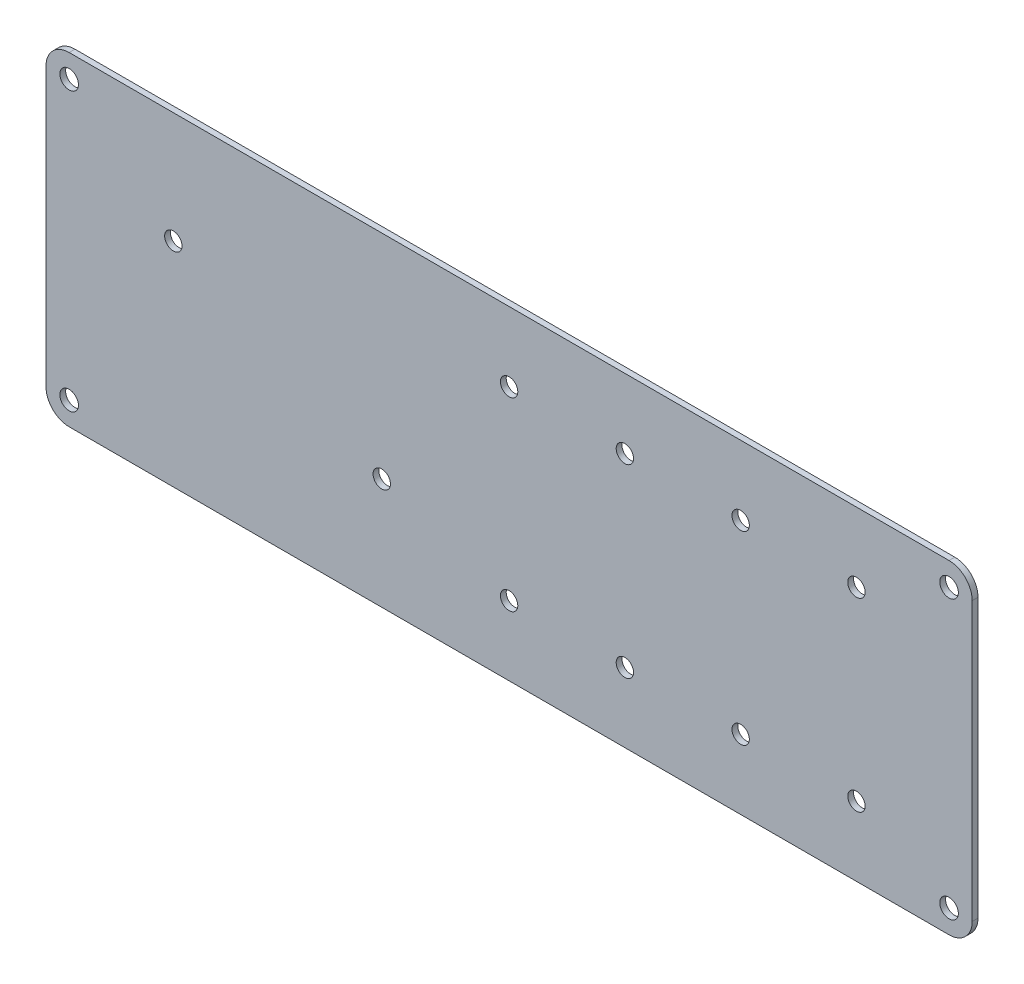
ISO-10303-21;
HEADER;
FILE_DESCRIPTION(('STEP AP214'),'2;1');
FILE_NAME('part.step','',(''),(''),'','','');
FILE_SCHEMA(('AUTOMOTIVE_DESIGN { 1 0 10303 214 1 1 1 1 }'));
ENDSEC;
DATA;
#1=APPLICATION_CONTEXT('core data for automotive mechanical design processes');
#2=APPLICATION_PROTOCOL_DEFINITION('international standard','automotive_design',2000,#1);
#3=PRODUCT_CONTEXT('',#1,'mechanical');
#4=PRODUCT('Part','Part','',(#3));
#5=PRODUCT_RELATED_PRODUCT_CATEGORY('part','',(#4));
#6=PRODUCT_DEFINITION_FORMATION('','',#4);
#7=PRODUCT_DEFINITION_CONTEXT('part definition',#1,'design');
#8=PRODUCT_DEFINITION('design','',#6,#7);
#9=PRODUCT_DEFINITION_SHAPE('','',#8);
#10=(LENGTH_UNIT() NAMED_UNIT(*) SI_UNIT(.MILLI.,.METRE.));
#11=(NAMED_UNIT(*) PLANE_ANGLE_UNIT() SI_UNIT($,.RADIAN.));
#12=(NAMED_UNIT(*) SI_UNIT($,.STERADIAN.) SOLID_ANGLE_UNIT());
#13=UNCERTAINTY_MEASURE_WITH_UNIT(LENGTH_MEASURE(1.E-05),#10,'distance_accuracy_value','');
#14=(GEOMETRIC_REPRESENTATION_CONTEXT(3) GLOBAL_UNCERTAINTY_ASSIGNED_CONTEXT((#13)) GLOBAL_UNIT_ASSIGNED_CONTEXT((#10,
#11,#12)) REPRESENTATION_CONTEXT('',''));
#15=CARTESIAN_POINT('',(0.,0.,0.));
#16=DIRECTION('',(0.,0.,1.));
#17=DIRECTION('',(1.,0.,0.));
#18=AXIS2_PLACEMENT_3D('',#15,#16,#17);
#19=CARTESIAN_POINT('',(0.,0.,1.5875));
#20=DIRECTION('',(1.,0.,0.));
#21=DIRECTION('',(0.,0.,-1.));
#22=AXIS2_PLACEMENT_3D('',#19,#20,#21);
#23=PLANE('',#22);
#24=DIRECTION('',(0.,-1.,0.));
#25=VECTOR('',#24,1.);
#26=CARTESIAN_POINT('',(0.,0.,0.));
#27=LINE('',#26,#25);
#28=CARTESIAN_POINT('',(0.,82.55,0.));
#29=VERTEX_POINT('',#28);
#30=CARTESIAN_POINT('',(0.,6.35,0.));
#31=VERTEX_POINT('',#30);
#32=EDGE_CURVE('E156',#29,#31,#27,.T.);
#33=ORIENTED_EDGE('',*,*,#32,.T.);
#34=DIRECTION('',(0.,0.,-1.));
#35=VECTOR('',#34,1.);
#36=CARTESIAN_POINT('',(0.,6.35,1.5875));
#37=LINE('',#36,#35);
#38=CARTESIAN_POINT('',(0.,6.35,1.5875));
#39=VERTEX_POINT('',#38);
#40=EDGE_CURVE('E11',#31,#39,#37,.F.);
#41=ORIENTED_EDGE('',*,*,#40,.T.);
#42=DIRECTION('',(0.,-1.,0.));
#43=VECTOR('',#42,1.);
#44=CARTESIAN_POINT('',(0.,0.,1.5875));
#45=LINE('',#44,#43);
#46=CARTESIAN_POINT('',(0.,82.55,1.5875));
#47=VERTEX_POINT('',#46);
#48=EDGE_CURVE('E124',#47,#39,#45,.T.);
#49=ORIENTED_EDGE('',*,*,#48,.F.);
#50=DIRECTION('',(0.,0.,-1.));
#51=VECTOR('',#50,1.);
#52=CARTESIAN_POINT('',(0.,82.55,1.5875));
#53=LINE('',#52,#51);
#54=EDGE_CURVE('E40',#47,#29,#53,.T.);
#55=ORIENTED_EDGE('',*,*,#54,.T.);
#56=EDGE_LOOP('',(#33,#41,#49,#55));
#57=FACE_BOUND('',#56,.T.);
#58=ADVANCED_FACE('F32',(#57),#23,.F.);
#59=CARTESIAN_POINT('',(0.,0.,1.5875));
#60=DIRECTION('',(0.,1.,0.));
#61=DIRECTION('',(0.,0.,1.));
#62=AXIS2_PLACEMENT_3D('',#59,#60,#61);
#63=PLANE('',#62);
#64=DIRECTION('',(1.,0.,0.));
#65=VECTOR('',#64,1.);
#66=CARTESIAN_POINT('',(0.,0.,0.));
#67=LINE('',#66,#65);
#68=CARTESIAN_POINT('',(6.35,0.,0.));
#69=VERTEX_POINT('',#68);
#70=CARTESIAN_POINT('',(247.65,0.,0.));
#71=VERTEX_POINT('',#70);
#72=EDGE_CURVE('E129',#69,#71,#67,.T.);
#73=ORIENTED_EDGE('',*,*,#72,.T.);
#74=DIRECTION('',(0.,0.,-1.));
#75=VECTOR('',#74,1.);
#76=CARTESIAN_POINT('',(247.65,0.,1.5875));
#77=LINE('',#76,#75);
#78=CARTESIAN_POINT('',(247.65,0.,1.5875));
#79=VERTEX_POINT('',#78);
#80=EDGE_CURVE('E47',#71,#79,#77,.F.);
#81=ORIENTED_EDGE('',*,*,#80,.T.);
#82=DIRECTION('',(1.,0.,0.));
#83=VECTOR('',#82,1.);
#84=CARTESIAN_POINT('',(0.,0.,1.5875));
#85=LINE('',#84,#83);
#86=CARTESIAN_POINT('',(6.35,0.,1.5875));
#87=VERTEX_POINT('',#86);
#88=EDGE_CURVE('E127',#87,#79,#85,.T.);
#89=ORIENTED_EDGE('',*,*,#88,.F.);
#90=DIRECTION('',(0.,0.,-1.));
#91=VECTOR('',#90,1.);
#92=CARTESIAN_POINT('',(6.35,0.,1.5875));
#93=LINE('',#92,#91);
#94=EDGE_CURVE('E148',#87,#69,#93,.T.);
#95=ORIENTED_EDGE('',*,*,#94,.T.);
#96=EDGE_LOOP('',(#73,#81,#89,#95));
#97=FACE_BOUND('',#96,.T.);
#98=ADVANCED_FACE('F303',(#97),#63,.F.);
#99=CARTESIAN_POINT('',(254.,0.,1.5875));
#100=DIRECTION('',(-1.,0.,0.));
#101=DIRECTION('',(0.,0.,1.));
#102=AXIS2_PLACEMENT_3D('',#99,#100,#101);
#103=PLANE('',#102);
#104=DIRECTION('',(0.,1.,0.));
#105=VECTOR('',#104,1.);
#106=CARTESIAN_POINT('',(254.,0.,0.));
#107=LINE('',#106,#105);
#108=CARTESIAN_POINT('',(254.,6.35,0.));
#109=VERTEX_POINT('',#108);
#110=CARTESIAN_POINT('',(254.,82.55,0.));
#111=VERTEX_POINT('',#110);
#112=EDGE_CURVE('E125',#109,#111,#107,.T.);
#113=ORIENTED_EDGE('',*,*,#112,.T.);
#114=DIRECTION('',(0.,0.,-1.));
#115=VECTOR('',#114,1.);
#116=CARTESIAN_POINT('',(254.,82.55,1.5875));
#117=LINE('',#116,#115);
#118=CARTESIAN_POINT('',(254.,82.55,1.5875));
#119=VERTEX_POINT('',#118);
#120=EDGE_CURVE('E103',#111,#119,#117,.F.);
#121=ORIENTED_EDGE('',*,*,#120,.T.);
#122=DIRECTION('',(0.,1.,0.));
#123=VECTOR('',#122,1.);
#124=CARTESIAN_POINT('',(254.,0.,1.5875));
#125=LINE('',#124,#123);
#126=CARTESIAN_POINT('',(254.,6.35,1.5875));
#127=VERTEX_POINT('',#126);
#128=EDGE_CURVE('E168',#127,#119,#125,.T.);
#129=ORIENTED_EDGE('',*,*,#128,.F.);
#130=DIRECTION('',(0.,0.,-1.));
#131=VECTOR('',#130,1.);
#132=CARTESIAN_POINT('',(254.,6.35,1.5875));
#133=LINE('',#132,#131);
#134=EDGE_CURVE('E108',#127,#109,#133,.T.);
#135=ORIENTED_EDGE('',*,*,#134,.T.);
#136=EDGE_LOOP('',(#113,#121,#129,#135));
#137=FACE_BOUND('',#136,.T.);
#138=ADVANCED_FACE('F300',(#137),#103,.F.);
#139=CARTESIAN_POINT('',(0.,88.9,1.5875));
#140=DIRECTION('',(0.,-1.,0.));
#141=DIRECTION('',(0.,0.,-1.));
#142=AXIS2_PLACEMENT_3D('',#139,#140,#141);
#143=PLANE('',#142);
#144=DIRECTION('',(-1.,0.,0.));
#145=VECTOR('',#144,1.);
#146=CARTESIAN_POINT('',(0.,88.9,1.5875));
#147=LINE('',#146,#145);
#148=CARTESIAN_POINT('',(247.65,88.9,1.5875));
#149=VERTEX_POINT('',#148);
#150=CARTESIAN_POINT('',(6.35,88.9,1.5875));
#151=VERTEX_POINT('',#150);
#152=EDGE_CURVE('E118',#149,#151,#147,.T.);
#153=ORIENTED_EDGE('',*,*,#152,.F.);
#154=DIRECTION('',(0.,0.,-1.));
#155=VECTOR('',#154,1.);
#156=CARTESIAN_POINT('',(247.65,88.9,1.5875));
#157=LINE('',#156,#155);
#158=CARTESIAN_POINT('',(247.65,88.9,0.));
#159=VERTEX_POINT('',#158);
#160=EDGE_CURVE('E102',#149,#159,#157,.T.);
#161=ORIENTED_EDGE('',*,*,#160,.T.);
#162=DIRECTION('',(-1.,0.,0.));
#163=VECTOR('',#162,1.);
#164=CARTESIAN_POINT('',(0.,88.9,0.));
#165=LINE('',#164,#163);
#166=CARTESIAN_POINT('',(6.35,88.9,0.));
#167=VERTEX_POINT('',#166);
#168=EDGE_CURVE('E115',#159,#167,#165,.T.);
#169=ORIENTED_EDGE('',*,*,#168,.T.);
#170=DIRECTION('',(0.,0.,-1.));
#171=VECTOR('',#170,1.);
#172=CARTESIAN_POINT('',(6.35,88.9,1.5875));
#173=LINE('',#172,#171);
#174=EDGE_CURVE('E120',#167,#151,#173,.F.);
#175=ORIENTED_EDGE('',*,*,#174,.T.);
#176=EDGE_LOOP('',(#153,#161,#169,#175));
#177=FACE_BOUND('',#176,.T.);
#178=ADVANCED_FACE('F114',(#177),#143,.F.);
#179=CARTESIAN_POINT('',(0.,0.,1.5875));
#180=DIRECTION('',(0.,0.,-1.));
#181=DIRECTION('',(-1.,0.,0.));
#182=AXIS2_PLACEMENT_3D('',#179,#180,#181);
#183=PLANE('',#182);
#184=CARTESIAN_POINT('',(92.075,30.48,1.5875));
#185=DIRECTION('',(0.,0.,-1.));
#186=DIRECTION('',(-1.,0.,0.));
#187=AXIS2_PLACEMENT_3D('',#184,#185,#186);
#188=CIRCLE('',#187,2.38125000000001);
#189=CARTESIAN_POINT('',(89.69375,30.48,1.5875));
#190=VERTEX_POINT('',#189);
#191=EDGE_CURVE('E246',#190,#190,#188,.T.);
#192=ORIENTED_EDGE('',*,*,#191,.T.);
#193=EDGE_LOOP('',(#192));
#194=FACE_BOUND('',#193,.T.);
#195=CARTESIAN_POINT('',(34.925,58.42,1.5875));
#196=DIRECTION('',(0.,0.,-1.));
#197=DIRECTION('',(-1.,0.,0.));
#198=AXIS2_PLACEMENT_3D('',#195,#196,#197);
#199=CIRCLE('',#198,2.38125);
#200=CARTESIAN_POINT('',(32.54375,58.42,1.5875));
#201=VERTEX_POINT('',#200);
#202=EDGE_CURVE('E238',#201,#201,#199,.T.);
#203=ORIENTED_EDGE('',*,*,#202,.T.);
#204=EDGE_LOOP('',(#203));
#205=FACE_BOUND('',#204,.T.);
#206=CARTESIAN_POINT('',(127.,69.85,1.5875));
#207=DIRECTION('',(0.,0.,-1.));
#208=DIRECTION('',(-1.,0.,0.));
#209=AXIS2_PLACEMENT_3D('',#206,#207,#208);
#210=CIRCLE('',#209,2.38124999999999);
#211=CARTESIAN_POINT('',(124.61875,69.85,1.5875));
#212=VERTEX_POINT('',#211);
#213=EDGE_CURVE('E232',#212,#212,#210,.T.);
#214=ORIENTED_EDGE('',*,*,#213,.T.);
#215=EDGE_LOOP('',(#214));
#216=FACE_BOUND('',#215,.T.);
#217=CARTESIAN_POINT('',(158.75,69.85,1.5875));
#218=DIRECTION('',(0.,0.,-1.));
#219=DIRECTION('',(-1.,0.,0.));
#220=AXIS2_PLACEMENT_3D('',#217,#218,#219);
#221=CIRCLE('',#220,2.38125);
#222=CARTESIAN_POINT('',(156.36875,69.85,1.5875));
#223=VERTEX_POINT('',#222);
#224=EDGE_CURVE('E226',#223,#223,#221,.T.);
#225=ORIENTED_EDGE('',*,*,#224,.T.);
#226=EDGE_LOOP('',(#225));
#227=FACE_BOUND('',#226,.T.);
#228=CARTESIAN_POINT('',(190.5,69.85,1.5875));
#229=DIRECTION('',(0.,0.,-1.));
#230=DIRECTION('',(-1.,0.,0.));
#231=AXIS2_PLACEMENT_3D('',#228,#229,#230);
#232=CIRCLE('',#231,2.38125);
#233=CARTESIAN_POINT('',(188.11875,69.85,1.5875));
#234=VERTEX_POINT('',#233);
#235=EDGE_CURVE('E220',#234,#234,#232,.T.);
#236=ORIENTED_EDGE('',*,*,#235,.T.);
#237=EDGE_LOOP('',(#236));
#238=FACE_BOUND('',#237,.T.);
#239=CARTESIAN_POINT('',(222.25,69.85,1.5875));
#240=DIRECTION('',(0.,0.,-1.));
#241=DIRECTION('',(-1.,0.,0.));
#242=AXIS2_PLACEMENT_3D('',#239,#240,#241);
#243=CIRCLE('',#242,2.38125);
#244=CARTESIAN_POINT('',(219.86875,69.85,1.5875));
#245=VERTEX_POINT('',#244);
#246=EDGE_CURVE('E214',#245,#245,#243,.T.);
#247=ORIENTED_EDGE('',*,*,#246,.T.);
#248=EDGE_LOOP('',(#247));
#249=FACE_BOUND('',#248,.T.);
#250=CARTESIAN_POINT('',(127.,19.05,1.5875));
#251=DIRECTION('',(0.,0.,-1.));
#252=DIRECTION('',(-1.,0.,0.));
#253=AXIS2_PLACEMENT_3D('',#250,#251,#252);
#254=CIRCLE('',#253,2.38125000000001);
#255=CARTESIAN_POINT('',(124.61875,19.05,1.5875));
#256=VERTEX_POINT('',#255);
#257=EDGE_CURVE('E208',#256,#256,#254,.T.);
#258=ORIENTED_EDGE('',*,*,#257,.T.);
#259=EDGE_LOOP('',(#258));
#260=FACE_BOUND('',#259,.T.);
#261=CARTESIAN_POINT('',(158.75,19.05,1.5875));
#262=DIRECTION('',(0.,0.,-1.));
#263=DIRECTION('',(-1.,0.,0.));
#264=AXIS2_PLACEMENT_3D('',#261,#262,#263);
#265=CIRCLE('',#264,2.38125000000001);
#266=CARTESIAN_POINT('',(156.36875,19.05,1.5875));
#267=VERTEX_POINT('',#266);
#268=EDGE_CURVE('E202',#267,#267,#265,.T.);
#269=ORIENTED_EDGE('',*,*,#268,.T.);
#270=EDGE_LOOP('',(#269));
#271=FACE_BOUND('',#270,.T.);
#272=CARTESIAN_POINT('',(190.5,19.05,1.5875));
#273=DIRECTION('',(0.,0.,-1.));
#274=DIRECTION('',(-1.,0.,0.));
#275=AXIS2_PLACEMENT_3D('',#272,#273,#274);
#276=CIRCLE('',#275,2.38125000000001);
#277=CARTESIAN_POINT('',(188.11875,19.05,1.5875));
#278=VERTEX_POINT('',#277);
#279=EDGE_CURVE('E196',#278,#278,#276,.T.);
#280=ORIENTED_EDGE('',*,*,#279,.T.);
#281=EDGE_LOOP('',(#280));
#282=FACE_BOUND('',#281,.T.);
#283=CARTESIAN_POINT('',(222.25,19.05,1.5875));
#284=DIRECTION('',(0.,0.,-1.));
#285=DIRECTION('',(-1.,0.,0.));
#286=AXIS2_PLACEMENT_3D('',#283,#284,#285);
#287=CIRCLE('',#286,2.38125000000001);
#288=CARTESIAN_POINT('',(219.86875,19.05,1.5875));
#289=VERTEX_POINT('',#288);
#290=EDGE_CURVE('E190',#289,#289,#287,.T.);
#291=ORIENTED_EDGE('',*,*,#290,.T.);
#292=EDGE_LOOP('',(#291));
#293=FACE_BOUND('',#292,.T.);
#294=CARTESIAN_POINT('',(6.34999999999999,6.35,1.5875));
#295=DIRECTION('',(0.,0.,1.));
#296=DIRECTION('',(1.,0.,0.));
#297=AXIS2_PLACEMENT_3D('',#294,#295,#296);
#298=CIRCLE('',#297,2.5527);
#299=CARTESIAN_POINT('',(8.90269999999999,6.35,1.5875));
#300=VERTEX_POINT('',#299);
#301=EDGE_CURVE('E187',#300,#300,#298,.T.);
#302=ORIENTED_EDGE('',*,*,#301,.F.);
#303=EDGE_LOOP('',(#302));
#304=FACE_BOUND('',#303,.T.);
#305=CARTESIAN_POINT('',(247.65,6.35,1.5875));
#306=DIRECTION('',(0.,0.,1.));
#307=DIRECTION('',(1.,0.,0.));
#308=AXIS2_PLACEMENT_3D('',#305,#306,#307);
#309=CIRCLE('',#308,2.55269999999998);
#310=CARTESIAN_POINT('',(250.2027,6.35,1.5875));
#311=VERTEX_POINT('',#310);
#312=EDGE_CURVE('E181',#311,#311,#309,.T.);
#313=ORIENTED_EDGE('',*,*,#312,.F.);
#314=EDGE_LOOP('',(#313));
#315=FACE_BOUND('',#314,.T.);
#316=CARTESIAN_POINT('',(247.65,82.55,1.5875));
#317=DIRECTION('',(0.,0.,1.));
#318=DIRECTION('',(1.,0.,0.));
#319=AXIS2_PLACEMENT_3D('',#316,#317,#318);
#320=CIRCLE('',#319,2.55270000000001);
#321=CARTESIAN_POINT('',(250.2027,82.55,1.5875));
#322=VERTEX_POINT('',#321);
#323=EDGE_CURVE('E175',#322,#322,#320,.T.);
#324=ORIENTED_EDGE('',*,*,#323,.F.);
#325=EDGE_LOOP('',(#324));
#326=FACE_BOUND('',#325,.T.);
#327=CARTESIAN_POINT('',(6.34999999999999,82.55,1.5875));
#328=DIRECTION('',(0.,0.,1.));
#329=DIRECTION('',(1.,0.,0.));
#330=AXIS2_PLACEMENT_3D('',#327,#328,#329);
#331=CIRCLE('',#330,2.5527);
#332=CARTESIAN_POINT('',(8.90269999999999,82.55,1.5875));
#333=VERTEX_POINT('',#332);
#334=EDGE_CURVE('E164',#333,#333,#331,.T.);
#335=ORIENTED_EDGE('',*,*,#334,.F.);
#336=EDGE_LOOP('',(#335));
#337=FACE_BOUND('',#336,.T.);
#338=ORIENTED_EDGE('',*,*,#128,.T.);
#339=CARTESIAN_POINT('',(247.65,82.55,1.5875));
#340=DIRECTION('',(0.,0.,-1.));
#341=DIRECTION('',(-1.,0.,0.));
#342=AXIS2_PLACEMENT_3D('',#339,#340,#341);
#343=CIRCLE('',#342,6.35);
#344=EDGE_CURVE('E146',#119,#149,#343,.F.);
#345=ORIENTED_EDGE('',*,*,#344,.T.);
#346=ORIENTED_EDGE('',*,*,#152,.T.);
#347=CARTESIAN_POINT('',(6.35,82.55,1.5875));
#348=DIRECTION('',(0.,0.,-1.));
#349=DIRECTION('',(-1.,0.,0.));
#350=AXIS2_PLACEMENT_3D('',#347,#348,#349);
#351=CIRCLE('',#350,6.35);
#352=EDGE_CURVE('E141',#151,#47,#351,.F.);
#353=ORIENTED_EDGE('',*,*,#352,.T.);
#354=ORIENTED_EDGE('',*,*,#48,.T.);
#355=CARTESIAN_POINT('',(6.35,6.35,1.5875));
#356=DIRECTION('',(0.,0.,-1.));
#357=DIRECTION('',(-1.,0.,0.));
#358=AXIS2_PLACEMENT_3D('',#355,#356,#357);
#359=CIRCLE('',#358,6.35);
#360=EDGE_CURVE('E54',#39,#87,#359,.F.);
#361=ORIENTED_EDGE('',*,*,#360,.T.);
#362=ORIENTED_EDGE('',*,*,#88,.T.);
#363=CARTESIAN_POINT('',(247.65,6.35,1.5875));
#364=DIRECTION('',(0.,0.,-1.));
#365=DIRECTION('',(-1.,0.,0.));
#366=AXIS2_PLACEMENT_3D('',#363,#364,#365);
#367=CIRCLE('',#366,6.35);
#368=EDGE_CURVE('E144',#79,#127,#367,.F.);
#369=ORIENTED_EDGE('',*,*,#368,.T.);
#370=EDGE_LOOP('',(#338,#345,#346,#353,#354,#361,#362,#369));
#371=FACE_BOUND('',#370,.T.);
#372=ADVANCED_FACE('F259',(#194,#205,#216,#227,#238,#249,#260,#271,#282,#293,#304,#315,#326,
#337,#371),#183,.F.);
#373=CARTESIAN_POINT('',(0.,0.,0.));
#374=DIRECTION('',(0.,0.,-1.));
#375=DIRECTION('',(-1.,0.,0.));
#376=AXIS2_PLACEMENT_3D('',#373,#374,#375);
#377=PLANE('',#376);
#378=CARTESIAN_POINT('',(92.075,30.48,0.));
#379=DIRECTION('',(0.,0.,-1.));
#380=DIRECTION('',(-1.,0.,0.));
#381=AXIS2_PLACEMENT_3D('',#378,#379,#380);
#382=CIRCLE('',#381,2.38125000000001);
#383=CARTESIAN_POINT('',(89.69375,30.48,0.));
#384=VERTEX_POINT('',#383);
#385=EDGE_CURVE('E249',#384,#384,#382,.T.);
#386=ORIENTED_EDGE('',*,*,#385,.F.);
#387=EDGE_LOOP('',(#386));
#388=FACE_BOUND('',#387,.T.);
#389=CARTESIAN_POINT('',(34.925,58.42,0.));
#390=DIRECTION('',(0.,0.,-1.));
#391=DIRECTION('',(-1.,0.,0.));
#392=AXIS2_PLACEMENT_3D('',#389,#390,#391);
#393=CIRCLE('',#392,2.38125);
#394=CARTESIAN_POINT('',(32.54375,58.42,0.));
#395=VERTEX_POINT('',#394);
#396=EDGE_CURVE('E243',#395,#395,#393,.T.);
#397=ORIENTED_EDGE('',*,*,#396,.F.);
#398=EDGE_LOOP('',(#397));
#399=FACE_BOUND('',#398,.T.);
#400=CARTESIAN_POINT('',(127.,69.85,0.));
#401=DIRECTION('',(0.,0.,-1.));
#402=DIRECTION('',(-1.,0.,0.));
#403=AXIS2_PLACEMENT_3D('',#400,#401,#402);
#404=CIRCLE('',#403,2.38124999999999);
#405=CARTESIAN_POINT('',(124.61875,69.85,0.));
#406=VERTEX_POINT('',#405);
#407=EDGE_CURVE('E235',#406,#406,#404,.T.);
#408=ORIENTED_EDGE('',*,*,#407,.F.);
#409=EDGE_LOOP('',(#408));
#410=FACE_BOUND('',#409,.T.);
#411=CARTESIAN_POINT('',(158.75,69.85,0.));
#412=DIRECTION('',(0.,0.,-1.));
#413=DIRECTION('',(-1.,0.,0.));
#414=AXIS2_PLACEMENT_3D('',#411,#412,#413);
#415=CIRCLE('',#414,2.38125);
#416=CARTESIAN_POINT('',(156.36875,69.85,0.));
#417=VERTEX_POINT('',#416);
#418=EDGE_CURVE('E229',#417,#417,#415,.T.);
#419=ORIENTED_EDGE('',*,*,#418,.F.);
#420=EDGE_LOOP('',(#419));
#421=FACE_BOUND('',#420,.T.);
#422=CARTESIAN_POINT('',(190.5,69.85,0.));
#423=DIRECTION('',(0.,0.,-1.));
#424=DIRECTION('',(-1.,0.,0.));
#425=AXIS2_PLACEMENT_3D('',#422,#423,#424);
#426=CIRCLE('',#425,2.38125);
#427=CARTESIAN_POINT('',(188.11875,69.85,0.));
#428=VERTEX_POINT('',#427);
#429=EDGE_CURVE('E223',#428,#428,#426,.T.);
#430=ORIENTED_EDGE('',*,*,#429,.F.);
#431=EDGE_LOOP('',(#430));
#432=FACE_BOUND('',#431,.T.);
#433=CARTESIAN_POINT('',(222.25,69.85,0.));
#434=DIRECTION('',(0.,0.,-1.));
#435=DIRECTION('',(-1.,0.,0.));
#436=AXIS2_PLACEMENT_3D('',#433,#434,#435);
#437=CIRCLE('',#436,2.38125);
#438=CARTESIAN_POINT('',(219.86875,69.85,0.));
#439=VERTEX_POINT('',#438);
#440=EDGE_CURVE('E217',#439,#439,#437,.T.);
#441=ORIENTED_EDGE('',*,*,#440,.F.);
#442=EDGE_LOOP('',(#441));
#443=FACE_BOUND('',#442,.T.);
#444=CARTESIAN_POINT('',(127.,19.05,0.));
#445=DIRECTION('',(0.,0.,-1.));
#446=DIRECTION('',(-1.,0.,0.));
#447=AXIS2_PLACEMENT_3D('',#444,#445,#446);
#448=CIRCLE('',#447,2.38125000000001);
#449=CARTESIAN_POINT('',(124.61875,19.05,0.));
#450=VERTEX_POINT('',#449);
#451=EDGE_CURVE('E211',#450,#450,#448,.T.);
#452=ORIENTED_EDGE('',*,*,#451,.F.);
#453=EDGE_LOOP('',(#452));
#454=FACE_BOUND('',#453,.T.);
#455=CARTESIAN_POINT('',(158.75,19.05,0.));
#456=DIRECTION('',(0.,0.,-1.));
#457=DIRECTION('',(-1.,0.,0.));
#458=AXIS2_PLACEMENT_3D('',#455,#456,#457);
#459=CIRCLE('',#458,2.38125000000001);
#460=CARTESIAN_POINT('',(156.36875,19.05,0.));
#461=VERTEX_POINT('',#460);
#462=EDGE_CURVE('E205',#461,#461,#459,.T.);
#463=ORIENTED_EDGE('',*,*,#462,.F.);
#464=EDGE_LOOP('',(#463));
#465=FACE_BOUND('',#464,.T.);
#466=CARTESIAN_POINT('',(190.5,19.05,0.));
#467=DIRECTION('',(0.,0.,-1.));
#468=DIRECTION('',(-1.,0.,0.));
#469=AXIS2_PLACEMENT_3D('',#466,#467,#468);
#470=CIRCLE('',#469,2.38125000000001);
#471=CARTESIAN_POINT('',(188.11875,19.05,0.));
#472=VERTEX_POINT('',#471);
#473=EDGE_CURVE('E199',#472,#472,#470,.T.);
#474=ORIENTED_EDGE('',*,*,#473,.F.);
#475=EDGE_LOOP('',(#474));
#476=FACE_BOUND('',#475,.T.);
#477=CARTESIAN_POINT('',(222.25,19.05,0.));
#478=DIRECTION('',(0.,0.,-1.));
#479=DIRECTION('',(-1.,0.,0.));
#480=AXIS2_PLACEMENT_3D('',#477,#478,#479);
#481=CIRCLE('',#480,2.38125000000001);
#482=CARTESIAN_POINT('',(219.86875,19.05,0.));
#483=VERTEX_POINT('',#482);
#484=EDGE_CURVE('E193',#483,#483,#481,.T.);
#485=ORIENTED_EDGE('',*,*,#484,.F.);
#486=EDGE_LOOP('',(#485));
#487=FACE_BOUND('',#486,.T.);
#488=CARTESIAN_POINT('',(6.34999999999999,6.35,0.));
#489=DIRECTION('',(0.,0.,1.));
#490=DIRECTION('',(1.,0.,0.));
#491=AXIS2_PLACEMENT_3D('',#488,#489,#490);
#492=CIRCLE('',#491,2.5527);
#493=CARTESIAN_POINT('',(8.90269999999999,6.35,0.));
#494=VERTEX_POINT('',#493);
#495=EDGE_CURVE('E184',#494,#494,#492,.T.);
#496=ORIENTED_EDGE('',*,*,#495,.T.);
#497=EDGE_LOOP('',(#496));
#498=FACE_BOUND('',#497,.T.);
#499=CARTESIAN_POINT('',(247.65,6.35,0.));
#500=DIRECTION('',(0.,0.,1.));
#501=DIRECTION('',(1.,0.,0.));
#502=AXIS2_PLACEMENT_3D('',#499,#500,#501);
#503=CIRCLE('',#502,2.55269999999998);
#504=CARTESIAN_POINT('',(250.2027,6.35,0.));
#505=VERTEX_POINT('',#504);
#506=EDGE_CURVE('E178',#505,#505,#503,.T.);
#507=ORIENTED_EDGE('',*,*,#506,.T.);
#508=EDGE_LOOP('',(#507));
#509=FACE_BOUND('',#508,.T.);
#510=CARTESIAN_POINT('',(247.65,82.55,0.));
#511=DIRECTION('',(0.,0.,1.));
#512=DIRECTION('',(1.,0.,0.));
#513=AXIS2_PLACEMENT_3D('',#510,#511,#512);
#514=CIRCLE('',#513,2.55270000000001);
#515=CARTESIAN_POINT('',(250.2027,82.55,0.));
#516=VERTEX_POINT('',#515);
#517=EDGE_CURVE('E173',#516,#516,#514,.T.);
#518=ORIENTED_EDGE('',*,*,#517,.T.);
#519=EDGE_LOOP('',(#518));
#520=FACE_BOUND('',#519,.T.);
#521=CARTESIAN_POINT('',(6.34999999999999,82.55,0.));
#522=DIRECTION('',(0.,0.,1.));
#523=DIRECTION('',(1.,0.,0.));
#524=AXIS2_PLACEMENT_3D('',#521,#522,#523);
#525=CIRCLE('',#524,2.5527);
#526=CARTESIAN_POINT('',(8.90269999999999,82.55,0.));
#527=VERTEX_POINT('',#526);
#528=EDGE_CURVE('E161',#527,#527,#525,.T.);
#529=ORIENTED_EDGE('',*,*,#528,.T.);
#530=EDGE_LOOP('',(#529));
#531=FACE_BOUND('',#530,.T.);
#532=ORIENTED_EDGE('',*,*,#168,.F.);
#533=CARTESIAN_POINT('',(247.65,82.55,0.));
#534=DIRECTION('',(0.,0.,-1.));
#535=DIRECTION('',(-1.,0.,0.));
#536=AXIS2_PLACEMENT_3D('',#533,#534,#535);
#537=CIRCLE('',#536,6.35);
#538=EDGE_CURVE('E98',#159,#111,#537,.T.);
#539=ORIENTED_EDGE('',*,*,#538,.T.);
#540=ORIENTED_EDGE('',*,*,#112,.F.);
#541=CARTESIAN_POINT('',(247.65,6.35,0.));
#542=DIRECTION('',(0.,0.,-1.));
#543=DIRECTION('',(-1.,0.,0.));
#544=AXIS2_PLACEMENT_3D('',#541,#542,#543);
#545=CIRCLE('',#544,6.35);
#546=EDGE_CURVE('E109',#109,#71,#545,.T.);
#547=ORIENTED_EDGE('',*,*,#546,.T.);
#548=ORIENTED_EDGE('',*,*,#72,.F.);
#549=CARTESIAN_POINT('',(6.35,6.35,0.));
#550=DIRECTION('',(0.,0.,-1.));
#551=DIRECTION('',(-1.,0.,0.));
#552=AXIS2_PLACEMENT_3D('',#549,#550,#551);
#553=CIRCLE('',#552,6.35);
#554=EDGE_CURVE('E135',#69,#31,#553,.T.);
#555=ORIENTED_EDGE('',*,*,#554,.T.);
#556=ORIENTED_EDGE('',*,*,#32,.F.);
#557=CARTESIAN_POINT('',(6.35,82.55,0.));
#558=DIRECTION('',(0.,0.,-1.));
#559=DIRECTION('',(-1.,0.,0.));
#560=AXIS2_PLACEMENT_3D('',#557,#558,#559);
#561=CIRCLE('',#560,6.35);
#562=EDGE_CURVE('E119',#29,#167,#561,.T.);
#563=ORIENTED_EDGE('',*,*,#562,.T.);
#564=EDGE_LOOP('',(#532,#539,#540,#547,#548,#555,#556,#563));
#565=FACE_BOUND('',#564,.T.);
#566=ADVANCED_FACE('F122',(#388,#399,#410,#421,#432,#443,#454,#465,#476,#487,#498,#509,#520,
#531,#565),#377,.T.);
#567=CARTESIAN_POINT('',(6.34999999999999,82.55,0.));
#568=DIRECTION('',(0.,0.,1.));
#569=DIRECTION('',(1.,0.,0.));
#570=AXIS2_PLACEMENT_3D('',#567,#568,#569);
#571=CYLINDRICAL_SURFACE('',#570,2.5527);
#572=ORIENTED_EDGE('',*,*,#528,.F.);
#573=EDGE_LOOP('',(#572));
#574=FACE_BOUND('',#573,.T.);
#575=ORIENTED_EDGE('',*,*,#334,.T.);
#576=EDGE_LOOP('',(#575));
#577=FACE_BOUND('',#576,.T.);
#578=ADVANCED_FACE('F258',(#574,#577),#571,.F.);
#579=CARTESIAN_POINT('',(247.65,82.55,0.));
#580=DIRECTION('',(0.,0.,1.));
#581=DIRECTION('',(1.,0.,0.));
#582=AXIS2_PLACEMENT_3D('',#579,#580,#581);
#583=CYLINDRICAL_SURFACE('',#582,2.55270000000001);
#584=ORIENTED_EDGE('',*,*,#517,.F.);
#585=EDGE_LOOP('',(#584));
#586=FACE_BOUND('',#585,.T.);
#587=ORIENTED_EDGE('',*,*,#323,.T.);
#588=EDGE_LOOP('',(#587));
#589=FACE_BOUND('',#588,.T.);
#590=ADVANCED_FACE('F289',(#586,#589),#583,.F.);
#591=CARTESIAN_POINT('',(247.65,6.35,0.));
#592=DIRECTION('',(0.,0.,1.));
#593=DIRECTION('',(1.,0.,0.));
#594=AXIS2_PLACEMENT_3D('',#591,#592,#593);
#595=CYLINDRICAL_SURFACE('',#594,2.55269999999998);
#596=ORIENTED_EDGE('',*,*,#506,.F.);
#597=EDGE_LOOP('',(#596));
#598=FACE_BOUND('',#597,.T.);
#599=ORIENTED_EDGE('',*,*,#312,.T.);
#600=EDGE_LOOP('',(#599));
#601=FACE_BOUND('',#600,.T.);
#602=ADVANCED_FACE('F455',(#598,#601),#595,.F.);
#603=CARTESIAN_POINT('',(6.34999999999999,6.35,0.));
#604=DIRECTION('',(0.,0.,1.));
#605=DIRECTION('',(1.,0.,0.));
#606=AXIS2_PLACEMENT_3D('',#603,#604,#605);
#607=CYLINDRICAL_SURFACE('',#606,2.5527);
#608=ORIENTED_EDGE('',*,*,#495,.F.);
#609=EDGE_LOOP('',(#608));
#610=FACE_BOUND('',#609,.T.);
#611=ORIENTED_EDGE('',*,*,#301,.T.);
#612=EDGE_LOOP('',(#611));
#613=FACE_BOUND('',#612,.T.);
#614=ADVANCED_FACE('F326',(#610,#613),#607,.F.);
#615=CARTESIAN_POINT('',(247.65,82.55,1.5875));
#616=DIRECTION('',(0.,0.,-1.));
#617=DIRECTION('',(-1.,0.,0.));
#618=AXIS2_PLACEMENT_3D('',#615,#616,#617);
#619=CYLINDRICAL_SURFACE('',#618,6.35);
#620=ORIENTED_EDGE('',*,*,#344,.F.);
#621=ORIENTED_EDGE('',*,*,#120,.F.);
#622=ORIENTED_EDGE('',*,*,#538,.F.);
#623=ORIENTED_EDGE('',*,*,#160,.F.);
#624=EDGE_LOOP('',(#620,#621,#622,#623));
#625=FACE_BOUND('',#624,.T.);
#626=ADVANCED_FACE('F101',(#625),#619,.T.);
#627=CARTESIAN_POINT('',(247.65,6.35,1.5875));
#628=DIRECTION('',(0.,0.,-1.));
#629=DIRECTION('',(-1.,0.,0.));
#630=AXIS2_PLACEMENT_3D('',#627,#628,#629);
#631=CYLINDRICAL_SURFACE('',#630,6.35);
#632=ORIENTED_EDGE('',*,*,#368,.F.);
#633=ORIENTED_EDGE('',*,*,#80,.F.);
#634=ORIENTED_EDGE('',*,*,#546,.F.);
#635=ORIENTED_EDGE('',*,*,#134,.F.);
#636=EDGE_LOOP('',(#632,#633,#634,#635));
#637=FACE_BOUND('',#636,.T.);
#638=ADVANCED_FACE('F302',(#637),#631,.T.);
#639=CARTESIAN_POINT('',(6.35,6.35,1.5875));
#640=DIRECTION('',(0.,0.,-1.));
#641=DIRECTION('',(-1.,0.,0.));
#642=AXIS2_PLACEMENT_3D('',#639,#640,#641);
#643=CYLINDRICAL_SURFACE('',#642,6.35);
#644=ORIENTED_EDGE('',*,*,#360,.F.);
#645=ORIENTED_EDGE('',*,*,#40,.F.);
#646=ORIENTED_EDGE('',*,*,#554,.F.);
#647=ORIENTED_EDGE('',*,*,#94,.F.);
#648=EDGE_LOOP('',(#644,#645,#646,#647));
#649=FACE_BOUND('',#648,.T.);
#650=ADVANCED_FACE('F306',(#649),#643,.T.);
#651=CARTESIAN_POINT('',(6.35,82.55,1.5875));
#652=DIRECTION('',(0.,0.,-1.));
#653=DIRECTION('',(-1.,0.,0.));
#654=AXIS2_PLACEMENT_3D('',#651,#652,#653);
#655=CYLINDRICAL_SURFACE('',#654,6.35);
#656=ORIENTED_EDGE('',*,*,#352,.F.);
#657=ORIENTED_EDGE('',*,*,#174,.F.);
#658=ORIENTED_EDGE('',*,*,#562,.F.);
#659=ORIENTED_EDGE('',*,*,#54,.F.);
#660=EDGE_LOOP('',(#656,#657,#658,#659));
#661=FACE_BOUND('',#660,.T.);
#662=ADVANCED_FACE('F34',(#661),#655,.T.);
#663=CARTESIAN_POINT('',(222.25,19.05,1.5875));
#664=DIRECTION('',(0.,0.,-1.));
#665=DIRECTION('',(-1.,0.,0.));
#666=AXIS2_PLACEMENT_3D('',#663,#664,#665);
#667=CYLINDRICAL_SURFACE('',#666,2.38125000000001);
#668=ORIENTED_EDGE('',*,*,#290,.F.);
#669=EDGE_LOOP('',(#668));
#670=FACE_BOUND('',#669,.T.);
#671=ORIENTED_EDGE('',*,*,#484,.T.);
#672=EDGE_LOOP('',(#671));
#673=FACE_BOUND('',#672,.T.);
#674=ADVANCED_FACE('F308',(#670,#673),#667,.F.);
#675=CARTESIAN_POINT('',(190.5,19.05,1.5875));
#676=DIRECTION('',(0.,0.,-1.));
#677=DIRECTION('',(-1.,0.,0.));
#678=AXIS2_PLACEMENT_3D('',#675,#676,#677);
#679=CYLINDRICAL_SURFACE('',#678,2.38125000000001);
#680=ORIENTED_EDGE('',*,*,#279,.F.);
#681=EDGE_LOOP('',(#680));
#682=FACE_BOUND('',#681,.T.);
#683=ORIENTED_EDGE('',*,*,#473,.T.);
#684=EDGE_LOOP('',(#683));
#685=FACE_BOUND('',#684,.T.);
#686=ADVANCED_FACE('F313',(#682,#685),#679,.F.);
#687=CARTESIAN_POINT('',(158.75,19.05,1.5875));
#688=DIRECTION('',(0.,0.,-1.));
#689=DIRECTION('',(-1.,0.,0.));
#690=AXIS2_PLACEMENT_3D('',#687,#688,#689);
#691=CYLINDRICAL_SURFACE('',#690,2.38125000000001);
#692=ORIENTED_EDGE('',*,*,#268,.F.);
#693=EDGE_LOOP('',(#692));
#694=FACE_BOUND('',#693,.T.);
#695=ORIENTED_EDGE('',*,*,#462,.T.);
#696=EDGE_LOOP('',(#695));
#697=FACE_BOUND('',#696,.T.);
#698=ADVANCED_FACE('F356',(#694,#697),#691,.F.);
#699=CARTESIAN_POINT('',(127.,19.05,1.5875));
#700=DIRECTION('',(0.,0.,-1.));
#701=DIRECTION('',(-1.,0.,0.));
#702=AXIS2_PLACEMENT_3D('',#699,#700,#701);
#703=CYLINDRICAL_SURFACE('',#702,2.38125000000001);
#704=ORIENTED_EDGE('',*,*,#257,.F.);
#705=EDGE_LOOP('',(#704));
#706=FACE_BOUND('',#705,.T.);
#707=ORIENTED_EDGE('',*,*,#451,.T.);
#708=EDGE_LOOP('',(#707));
#709=FACE_BOUND('',#708,.T.);
#710=ADVANCED_FACE('F366',(#706,#709),#703,.F.);
#711=CARTESIAN_POINT('',(222.25,69.85,1.5875));
#712=DIRECTION('',(0.,0.,-1.));
#713=DIRECTION('',(-1.,0.,0.));
#714=AXIS2_PLACEMENT_3D('',#711,#712,#713);
#715=CYLINDRICAL_SURFACE('',#714,2.38125);
#716=ORIENTED_EDGE('',*,*,#246,.F.);
#717=EDGE_LOOP('',(#716));
#718=FACE_BOUND('',#717,.T.);
#719=ORIENTED_EDGE('',*,*,#440,.T.);
#720=EDGE_LOOP('',(#719));
#721=FACE_BOUND('',#720,.T.);
#722=ADVANCED_FACE('F376',(#718,#721),#715,.F.);
#723=CARTESIAN_POINT('',(190.5,69.85,1.5875));
#724=DIRECTION('',(0.,0.,-1.));
#725=DIRECTION('',(-1.,0.,0.));
#726=AXIS2_PLACEMENT_3D('',#723,#724,#725);
#727=CYLINDRICAL_SURFACE('',#726,2.38125);
#728=ORIENTED_EDGE('',*,*,#235,.F.);
#729=EDGE_LOOP('',(#728));
#730=FACE_BOUND('',#729,.T.);
#731=ORIENTED_EDGE('',*,*,#429,.T.);
#732=EDGE_LOOP('',(#731));
#733=FACE_BOUND('',#732,.T.);
#734=ADVANCED_FACE('F386',(#730,#733),#727,.F.);
#735=CARTESIAN_POINT('',(158.75,69.85,1.5875));
#736=DIRECTION('',(0.,0.,-1.));
#737=DIRECTION('',(-1.,0.,0.));
#738=AXIS2_PLACEMENT_3D('',#735,#736,#737);
#739=CYLINDRICAL_SURFACE('',#738,2.38125);
#740=ORIENTED_EDGE('',*,*,#224,.F.);
#741=EDGE_LOOP('',(#740));
#742=FACE_BOUND('',#741,.T.);
#743=ORIENTED_EDGE('',*,*,#418,.T.);
#744=EDGE_LOOP('',(#743));
#745=FACE_BOUND('',#744,.T.);
#746=ADVANCED_FACE('F396',(#742,#745),#739,.F.);
#747=CARTESIAN_POINT('',(127.,69.85,1.5875));
#748=DIRECTION('',(0.,0.,-1.));
#749=DIRECTION('',(-1.,0.,0.));
#750=AXIS2_PLACEMENT_3D('',#747,#748,#749);
#751=CYLINDRICAL_SURFACE('',#750,2.38124999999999);
#752=ORIENTED_EDGE('',*,*,#213,.F.);
#753=EDGE_LOOP('',(#752));
#754=FACE_BOUND('',#753,.T.);
#755=ORIENTED_EDGE('',*,*,#407,.T.);
#756=EDGE_LOOP('',(#755));
#757=FACE_BOUND('',#756,.T.);
#758=ADVANCED_FACE('F406',(#754,#757),#751,.F.);
#759=CARTESIAN_POINT('',(34.925,58.42,3.175));
#760=DIRECTION('',(0.,0.,-1.));
#761=DIRECTION('',(-1.,0.,0.));
#762=AXIS2_PLACEMENT_3D('',#759,#760,#761);
#763=CYLINDRICAL_SURFACE('',#762,2.38125);
#764=ORIENTED_EDGE('',*,*,#396,.T.);
#765=EDGE_LOOP('',(#764));
#766=FACE_BOUND('',#765,.T.);
#767=ORIENTED_EDGE('',*,*,#202,.F.);
#768=EDGE_LOOP('',(#767));
#769=FACE_BOUND('',#768,.T.);
#770=ADVANCED_FACE('F416',(#766,#769),#763,.F.);
#771=CARTESIAN_POINT('',(92.075,30.48,3.175));
#772=DIRECTION('',(0.,0.,-1.));
#773=DIRECTION('',(-1.,0.,0.));
#774=AXIS2_PLACEMENT_3D('',#771,#772,#773);
#775=CYLINDRICAL_SURFACE('',#774,2.38125000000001);
#776=ORIENTED_EDGE('',*,*,#385,.T.);
#777=EDGE_LOOP('',(#776));
#778=FACE_BOUND('',#777,.T.);
#779=ORIENTED_EDGE('',*,*,#191,.F.);
#780=EDGE_LOOP('',(#779));
#781=FACE_BOUND('',#780,.T.);
#782=ADVANCED_FACE('F253',(#778,#781),#775,.F.);
#783=CLOSED_SHELL('',(#58,#98,#138,#178,#372,#566,#578,#590,#602,#614,#626,#638,#650,#662,#674,
#686,#698,#710,#722,#734,#746,#758,#770,#782));
#784=MANIFOLD_SOLID_BREP('B2',#783);
#785=ADVANCED_BREP_SHAPE_REPRESENTATION('',(#18,#784),#14);
#786=SHAPE_DEFINITION_REPRESENTATION(#9,#785);
ENDSEC;
END-ISO-10303-21;
